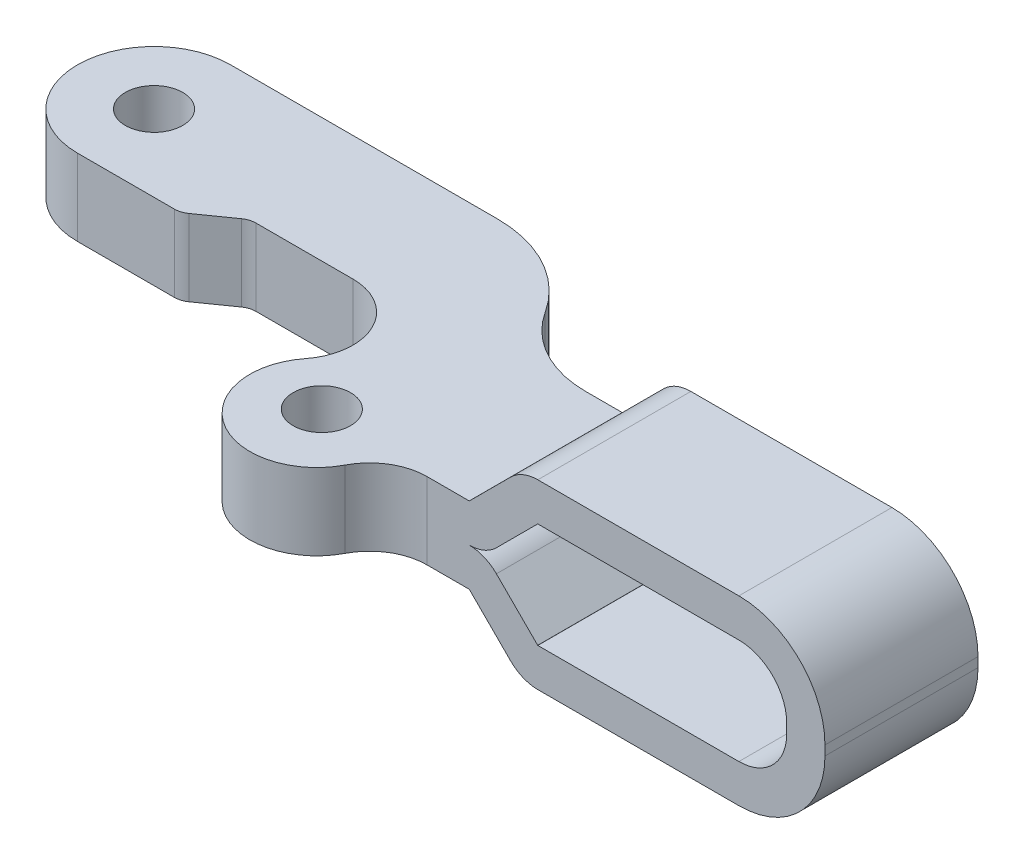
ISO-10303-21;
HEADER;
FILE_DESCRIPTION(('STEP AP214'),'2;1');
FILE_NAME('part.step','',(''),(''),'','','');
FILE_SCHEMA(('AUTOMOTIVE_DESIGN { 1 0 10303 214 1 1 1 1 }'));
ENDSEC;
DATA;
#1=APPLICATION_CONTEXT('core data for automotive mechanical design processes');
#2=APPLICATION_PROTOCOL_DEFINITION('international standard','automotive_design',2000,#1);
#3=PRODUCT_CONTEXT('',#1,'mechanical');
#4=PRODUCT('Part','Part','',(#3));
#5=PRODUCT_RELATED_PRODUCT_CATEGORY('part','',(#4));
#6=PRODUCT_DEFINITION_FORMATION('','',#4);
#7=PRODUCT_DEFINITION_CONTEXT('part definition',#1,'design');
#8=PRODUCT_DEFINITION('design','',#6,#7);
#9=PRODUCT_DEFINITION_SHAPE('','',#8);
#10=(LENGTH_UNIT() NAMED_UNIT(*) SI_UNIT(.MILLI.,.METRE.));
#11=(NAMED_UNIT(*) PLANE_ANGLE_UNIT() SI_UNIT($,.RADIAN.));
#12=(NAMED_UNIT(*) SI_UNIT($,.STERADIAN.) SOLID_ANGLE_UNIT());
#13=UNCERTAINTY_MEASURE_WITH_UNIT(LENGTH_MEASURE(1.E-05),#10,'distance_accuracy_value','');
#14=(GEOMETRIC_REPRESENTATION_CONTEXT(3) GLOBAL_UNCERTAINTY_ASSIGNED_CONTEXT((#13)) GLOBAL_UNIT_ASSIGNED_CONTEXT((#10,
#11,#12)) REPRESENTATION_CONTEXT('',''));
#15=CARTESIAN_POINT('',(0.,0.,0.));
#16=DIRECTION('',(0.,0.,1.));
#17=DIRECTION('',(1.,0.,0.));
#18=AXIS2_PLACEMENT_3D('',#15,#16,#17);
#19=CARTESIAN_POINT('',(45.7788506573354,2.,1.50570552));
#20=DIRECTION('',(0.,0.,1.));
#21=DIRECTION('',(0.,1.,0.));
#22=AXIS2_PLACEMENT_3D('',#19,#20,#21);
#23=PLANE('',#22);
#24=DIRECTION('',(0.,1.,0.));
#25=VECTOR('',#24,1.);
#26=CARTESIAN_POINT('',(44.5788506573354,1.09995593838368,1.50570552));
#27=LINE('',#26,#25);
#28=CARTESIAN_POINT('',(44.5788506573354,-0.25,1.50570552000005));
#29=VERTEX_POINT('',#28);
#30=CARTESIAN_POINT('',(44.5788506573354,0.24999999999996,1.50570552));
#31=VERTEX_POINT('',#30);
#32=EDGE_CURVE('E377',#29,#31,#27,.T.);
#33=ORIENTED_EDGE('',*,*,#32,.F.);
#34=CARTESIAN_POINT('',(40.0788506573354,-0.25000000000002,1.50570552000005));
#35=DIRECTION('',(0.,0.,-1.));
#36=DIRECTION('',(-1.,0.,0.));
#37=AXIS2_PLACEMENT_3D('',#34,#35,#36);
#38=CIRCLE('',#37,4.5);
#39=CARTESIAN_POINT('',(40.0788506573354,-4.75,1.50570552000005));
#40=VERTEX_POINT('',#39);
#41=EDGE_CURVE('E331',#40,#29,#38,.F.);
#42=ORIENTED_EDGE('',*,*,#41,.F.);
#43=DIRECTION('',(-1.,0.,0.));
#44=VECTOR('',#43,1.);
#45=CARTESIAN_POINT('',(11.8413847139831,-4.75,1.50570552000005));
#46=LINE('',#45,#44);
#47=CARTESIAN_POINT('',(29.5689359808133,-4.75,1.50570552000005));
#48=VERTEX_POINT('',#47);
#49=EDGE_CURVE('E320',#40,#48,#46,.T.);
#50=ORIENTED_EDGE('',*,*,#49,.T.);
#51=CARTESIAN_POINT('',(29.5689359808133,-2.74,1.50570552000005));
#52=DIRECTION('',(0.,0.,-1.));
#53=DIRECTION('',(-1.,0.,0.));
#54=AXIS2_PLACEMENT_3D('',#51,#52,#53);
#55=CIRCLE('',#54,2.01);
#56=CARTESIAN_POINT('',(28.1476513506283,-4.16128463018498,1.50570552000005));
#57=VERTEX_POINT('',#56);
#58=EDGE_CURVE('E322',#57,#48,#55,.F.);
#59=ORIENTED_EDGE('',*,*,#58,.F.);
#60=DIRECTION('',(-0.707106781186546,0.707106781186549,0.));
#61=VECTOR('',#60,1.);
#62=CARTESIAN_POINT('',(16.1732936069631,7.81307311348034,1.50570552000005));
#63=LINE('',#62,#61);
#64=CARTESIAN_POINT('',(25.9892956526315,-2.00292893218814,1.50570552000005));
#65=VERTEX_POINT('',#64);
#66=EDGE_CURVE('E301',#57,#65,#63,.T.);
#67=ORIENTED_EDGE('',*,*,#66,.T.);
#68=CARTESIAN_POINT('',(25.9822245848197,-2.01,1.50570552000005));
#69=DIRECTION('',(0.,0.,-1.));
#70=DIRECTION('',(0.,-1.,0.));
#71=AXIS2_PLACEMENT_3D('',#68,#69,#70);
#72=CIRCLE('',#71,0.00999999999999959);
#73=CARTESIAN_POINT('',(25.9822245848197,-2.,1.50570552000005));
#74=VERTEX_POINT('',#73);
#75=EDGE_CURVE('E311',#65,#74,#72,.F.);
#76=ORIENTED_EDGE('',*,*,#75,.T.);
#77=DIRECTION('',(-1.,0.,0.));
#78=VECTOR('',#77,1.);
#79=CARTESIAN_POINT('',(12.8935535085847,-2.,1.50570552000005));
#80=LINE('',#79,#78);
#81=CARTESIAN_POINT('',(24.0552058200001,-2.,1.50570552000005));
#82=VERTEX_POINT('',#81);
#83=EDGE_CURVE('E298',#74,#82,#80,.T.);
#84=ORIENTED_EDGE('',*,*,#83,.T.);
#85=DIRECTION('',(0.,1.,0.));
#86=VECTOR('',#85,1.);
#87=CARTESIAN_POINT('',(24.05520582,2.,1.50570552));
#88=LINE('',#87,#86);
#89=CARTESIAN_POINT('',(24.05520582,2.,1.50570552));
#90=VERTEX_POINT('',#89);
#91=EDGE_CURVE('E898',#90,#82,#88,.F.);
#92=ORIENTED_EDGE('',*,*,#91,.F.);
#93=DIRECTION('',(-1.,0.,0.));
#94=VECTOR('',#93,1.);
#95=CARTESIAN_POINT('',(45.7788506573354,2.,1.50570552));
#96=LINE('',#95,#94);
#97=CARTESIAN_POINT('',(25.9822245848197,2.,1.50570552));
#98=VERTEX_POINT('',#97);
#99=EDGE_CURVE('E24',#98,#90,#96,.T.);
#100=ORIENTED_EDGE('',*,*,#99,.F.);
#101=CARTESIAN_POINT('',(25.9822245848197,2.01,1.50570552));
#102=DIRECTION('',(0.,0.,-1.));
#103=DIRECTION('',(-1.,0.,0.));
#104=AXIS2_PLACEMENT_3D('',#101,#102,#103);
#105=CIRCLE('',#104,0.00999999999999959);
#106=CARTESIAN_POINT('',(25.9892956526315,2.0029289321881,1.50570552));
#107=VERTEX_POINT('',#106);
#108=EDGE_CURVE('E420',#107,#98,#105,.T.);
#109=ORIENTED_EDGE('',*,*,#108,.F.);
#110=DIRECTION('',(-0.707106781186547,-0.707106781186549,0.));
#111=VECTOR('',#110,1.);
#112=CARTESIAN_POINT('',(28.1476513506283,4.16128463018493,1.50570552));
#113=LINE('',#112,#111);
#114=CARTESIAN_POINT('',(28.1476513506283,4.16128463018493,1.50570552));
#115=VERTEX_POINT('',#114);
#116=EDGE_CURVE('E433',#115,#107,#113,.T.);
#117=ORIENTED_EDGE('',*,*,#116,.F.);
#118=CARTESIAN_POINT('',(29.5689359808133,2.74,1.50570552));
#119=DIRECTION('',(0.,0.,-1.));
#120=DIRECTION('',(-1.,0.,0.));
#121=AXIS2_PLACEMENT_3D('',#118,#119,#120);
#122=CIRCLE('',#121,2.01);
#123=CARTESIAN_POINT('',(29.5689359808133,4.75,1.50570552));
#124=VERTEX_POINT('',#123);
#125=EDGE_CURVE('E435',#115,#124,#122,.T.);
#126=ORIENTED_EDGE('',*,*,#125,.T.);
#127=DIRECTION('',(1.,0.,0.));
#128=VECTOR('',#127,1.);
#129=CARTESIAN_POINT('',(44.7266818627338,4.75,1.50570552));
#130=LINE('',#129,#128);
#131=CARTESIAN_POINT('',(40.0788506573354,4.75,1.50570552));
#132=VERTEX_POINT('',#131);
#133=EDGE_CURVE('E448',#132,#124,#130,.F.);
#134=ORIENTED_EDGE('',*,*,#133,.F.);
#135=CARTESIAN_POINT('',(40.0788506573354,0.24999999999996,1.50570552));
#136=DIRECTION('',(0.,0.,-1.));
#137=DIRECTION('',(-1.,0.,0.));
#138=AXIS2_PLACEMENT_3D('',#135,#136,#137);
#139=CIRCLE('',#138,4.5);
#140=EDGE_CURVE('E253',#132,#31,#139,.T.);
#141=ORIENTED_EDGE('',*,*,#140,.T.);
#142=EDGE_LOOP('',(#33,#42,#50,#59,#67,#76,#84,#92,#100,#109,#117,#126,#134,#141));
#143=FACE_BOUND('',#142,.T.);
#144=CARTESIAN_POINT('',(40.0788506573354,-0.25000000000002,1.50570552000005));
#145=DIRECTION('',(0.,0.,-1.));
#146=DIRECTION('',(-1.,0.,0.));
#147=AXIS2_PLACEMENT_3D('',#144,#145,#146);
#148=CIRCLE('',#147,2.5);
#149=CARTESIAN_POINT('',(42.5788506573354,-0.25,1.50570552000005));
#150=VERTEX_POINT('',#149);
#151=CARTESIAN_POINT('',(40.0788506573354,-2.75,1.50570552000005));
#152=VERTEX_POINT('',#151);
#153=EDGE_CURVE('E18',#150,#152,#148,.T.);
#154=ORIENTED_EDGE('',*,*,#153,.F.);
#155=DIRECTION('',(0.,1.,0.));
#156=VECTOR('',#155,1.);
#157=CARTESIAN_POINT('',(42.5788506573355,33.9852530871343,1.50570552));
#158=LINE('',#157,#156);
#159=CARTESIAN_POINT('',(42.5788506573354,0.24999999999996,1.50570552));
#160=VERTEX_POINT('',#159);
#161=EDGE_CURVE('E242',#150,#160,#158,.T.);
#162=ORIENTED_EDGE('',*,*,#161,.T.);
#163=CARTESIAN_POINT('',(40.0788506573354,0.24999999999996,1.50570552));
#164=DIRECTION('',(0.,0.,-1.));
#165=DIRECTION('',(-1.,0.,0.));
#166=AXIS2_PLACEMENT_3D('',#163,#164,#165);
#167=CIRCLE('',#166,2.5);
#168=CARTESIAN_POINT('',(40.0788506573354,2.75,1.50570552));
#169=VERTEX_POINT('',#168);
#170=EDGE_CURVE('E446',#160,#169,#167,.F.);
#171=ORIENTED_EDGE('',*,*,#170,.T.);
#172=DIRECTION('',(-1.,0.,0.));
#173=VECTOR('',#172,1.);
#174=CARTESIAN_POINT('',(11.8413847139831,2.75,1.50570552));
#175=LINE('',#174,#173);
#176=CARTESIAN_POINT('',(29.5689359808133,2.75,1.50570552));
#177=VERTEX_POINT('',#176);
#178=EDGE_CURVE('E442',#169,#177,#175,.T.);
#179=ORIENTED_EDGE('',*,*,#178,.T.);
#180=CARTESIAN_POINT('',(29.5689359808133,2.74,1.50570552));
#181=DIRECTION('',(0.,0.,-1.));
#182=DIRECTION('',(0.,-1.,0.));
#183=AXIS2_PLACEMENT_3D('',#180,#181,#182);
#184=CIRCLE('',#183,0.00999999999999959);
#185=CARTESIAN_POINT('',(29.5618649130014,2.74707106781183,1.50570552));
#186=VERTEX_POINT('',#185);
#187=EDGE_CURVE('E431',#177,#186,#184,.F.);
#188=ORIENTED_EDGE('',*,*,#187,.T.);
#189=DIRECTION('',(-0.707106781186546,-0.707106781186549,0.));
#190=VECTOR('',#189,1.);
#191=CARTESIAN_POINT('',(17.5875071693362,-9.22728667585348,1.50570552));
#192=LINE('',#191,#190);
#193=CARTESIAN_POINT('',(27.4035092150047,0.58871536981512,1.50570552));
#194=VERTEX_POINT('',#193);
#195=EDGE_CURVE('E423',#186,#194,#192,.T.);
#196=ORIENTED_EDGE('',*,*,#195,.T.);
#197=CARTESIAN_POINT('',(25.9822245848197,2.01,1.50570552));
#198=DIRECTION('',(0.,0.,-1.));
#199=DIRECTION('',(-1.,0.,0.));
#200=AXIS2_PLACEMENT_3D('',#197,#198,#199);
#201=CIRCLE('',#200,2.01);
#202=CARTESIAN_POINT('',(25.9822245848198,0.,1.50570552));
#203=VERTEX_POINT('',#202);
#204=EDGE_CURVE('E390',#203,#194,#201,.F.);
#205=ORIENTED_EDGE('',*,*,#204,.F.);
#206=CARTESIAN_POINT('',(25.9822245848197,-2.01,1.50570552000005));
#207=DIRECTION('',(0.,0.,-1.));
#208=DIRECTION('',(-1.,0.,0.));
#209=AXIS2_PLACEMENT_3D('',#206,#207,#208);
#210=CIRCLE('',#209,2.01);
#211=CARTESIAN_POINT('',(27.4035092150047,-0.588715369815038,1.50570552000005));
#212=VERTEX_POINT('',#211);
#213=EDGE_CURVE('E308',#203,#212,#210,.T.);
#214=ORIENTED_EDGE('',*,*,#213,.T.);
#215=DIRECTION('',(-0.707106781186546,0.70710678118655,0.));
#216=VECTOR('',#215,1.);
#217=CARTESIAN_POINT('',(29.5618649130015,-2.74707106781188,1.50570552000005));
#218=LINE('',#217,#216);
#219=CARTESIAN_POINT('',(29.5618649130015,-2.74707106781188,1.50570552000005));
#220=VERTEX_POINT('',#219);
#221=EDGE_CURVE('E316',#220,#212,#218,.T.);
#222=ORIENTED_EDGE('',*,*,#221,.F.);
#223=CARTESIAN_POINT('',(29.5689359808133,-2.74,1.50570552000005));
#224=DIRECTION('',(0.,0.,-1.));
#225=DIRECTION('',(-1.,0.,0.));
#226=AXIS2_PLACEMENT_3D('',#223,#224,#225);
#227=CIRCLE('',#226,0.00999999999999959);
#228=CARTESIAN_POINT('',(29.5689359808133,-2.75,1.50570552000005));
#229=VERTEX_POINT('',#228);
#230=EDGE_CURVE('E325',#229,#220,#227,.T.);
#231=ORIENTED_EDGE('',*,*,#230,.F.);
#232=DIRECTION('',(1.,0.,0.));
#233=VECTOR('',#232,1.);
#234=CARTESIAN_POINT('',(44.7266818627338,-2.75,1.50570552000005));
#235=LINE('',#234,#233);
#236=EDGE_CURVE('E266',#152,#229,#235,.F.);
#237=ORIENTED_EDGE('',*,*,#236,.F.);
#238=EDGE_LOOP('',(#154,#162,#171,#179,#188,#196,#205,#214,#222,#231,#237));
#239=FACE_BOUND('',#238,.T.);
#240=ADVANCED_FACE('F14',(#143,#239),#23,.F.);
#241=CARTESIAN_POINT('',(24.05520582,2.,-3.99429447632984));
#242=DIRECTION('',(0.,-1.,0.));
#243=DIRECTION('',(1.,0.,0.));
#244=AXIS2_PLACEMENT_3D('',#241,#242,#243);
#245=CYLINDRICAL_SURFACE('',#244,5.49999999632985);
#246=DIRECTION('',(0.,-1.,0.));
#247=VECTOR('',#246,1.);
#248=CARTESIAN_POINT('',(19.4302582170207,2.,-1.01774284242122));
#249=LINE('',#248,#247);
#250=CARTESIAN_POINT('',(19.4302582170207,2.,-1.01774284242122));
#251=VERTEX_POINT('',#250);
#252=CARTESIAN_POINT('',(19.4302582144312,-2.,-1.01774284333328));
#253=VERTEX_POINT('',#252);
#254=EDGE_CURVE('E411',#251,#253,#249,.T.);
#255=ORIENTED_EDGE('',*,*,#254,.F.);
#256=CARTESIAN_POINT('',(24.05520582,2.,-3.99429447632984));
#257=DIRECTION('',(0.,-1.,0.));
#258=DIRECTION('',(1.,0.,0.));
#259=AXIS2_PLACEMENT_3D('',#256,#257,#258);
#260=CIRCLE('',#259,5.49999999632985);
#261=EDGE_CURVE('E412',#90,#251,#260,.T.);
#262=ORIENTED_EDGE('',*,*,#261,.F.);
#263=ORIENTED_EDGE('',*,*,#91,.T.);
#264=CARTESIAN_POINT('',(24.0552058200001,-2.,-3.99429447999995));
#265=DIRECTION('',(0.,-1.,0.));
#266=DIRECTION('',(1.,0.,0.));
#267=AXIS2_PLACEMENT_3D('',#264,#265,#266);
#268=CIRCLE('',#267,5.5);
#269=EDGE_CURVE('E295',#82,#253,#268,.T.);
#270=ORIENTED_EDGE('',*,*,#269,.T.);
#271=EDGE_LOOP('',(#255,#262,#263,#270));
#272=FACE_BOUND('',#271,.T.);
#273=ADVANCED_FACE('F535',(#272),#245,.F.);
#274=CARTESIAN_POINT('',(13.9644110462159,2.,2.5));
#275=DIRECTION('',(0.,-1.,0.));
#276=DIRECTION('',(1.,0.,0.));
#277=AXIS2_PLACEMENT_3D('',#274,#275,#276);
#278=CYLINDRICAL_SURFACE('',#277,6.5);
#279=CARTESIAN_POINT('',(13.9644110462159,2.,2.5));
#280=DIRECTION('',(0.,-1.,0.));
#281=DIRECTION('',(1.,0.,0.));
#282=AXIS2_PLACEMENT_3D('',#279,#280,#281);
#283=CIRCLE('',#282,6.5);
#284=CARTESIAN_POINT('',(13.9644110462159,2.,-4.));
#285=VERTEX_POINT('',#284);
#286=EDGE_CURVE('E409',#285,#251,#283,.T.);
#287=ORIENTED_EDGE('',*,*,#286,.T.);
#288=ORIENTED_EDGE('',*,*,#254,.T.);
#289=CARTESIAN_POINT('',(13.9644110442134,-2.,2.5000000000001));
#290=DIRECTION('',(0.,-1.,0.));
#291=DIRECTION('',(1.,0.,0.));
#292=AXIS2_PLACEMENT_3D('',#289,#290,#291);
#293=CIRCLE('',#292,6.5);
#294=CARTESIAN_POINT('',(13.9644110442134,-2.,-3.99999999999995));
#295=VERTEX_POINT('',#294);
#296=EDGE_CURVE('E292',#253,#295,#293,.F.);
#297=ORIENTED_EDGE('',*,*,#296,.T.);
#298=DIRECTION('',(0.,1.,0.));
#299=VECTOR('',#298,1.);
#300=CARTESIAN_POINT('',(13.9644110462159,2.,-4.));
#301=LINE('',#300,#299);
#302=EDGE_CURVE('E972',#295,#285,#301,.T.);
#303=ORIENTED_EDGE('',*,*,#302,.T.);
#304=EDGE_LOOP('',(#287,#288,#297,#303));
#305=FACE_BOUND('',#304,.T.);
#306=ADVANCED_FACE('F541',(#305),#278,.T.);
#307=CARTESIAN_POINT('',(0.,2.,-4.));
#308=DIRECTION('',(0.,0.,1.));
#309=DIRECTION('',(1.,0.,0.));
#310=AXIS2_PLACEMENT_3D('',#307,#308,#309);
#311=PLANE('',#310);
#312=DIRECTION('',(0.,-1.,0.));
#313=VECTOR('',#312,1.);
#314=CARTESIAN_POINT('',(0.,2.,-4.));
#315=LINE('',#314,#313);
#316=CARTESIAN_POINT('',(0.,2.,-4.));
#317=VERTEX_POINT('',#316);
#318=CARTESIAN_POINT('',(0.,-2.,-3.99999999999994));
#319=VERTEX_POINT('',#318);
#320=EDGE_CURVE('E407',#317,#319,#315,.T.);
#321=ORIENTED_EDGE('',*,*,#320,.F.);
#322=DIRECTION('',(1.,0.,0.));
#323=VECTOR('',#322,1.);
#324=CARTESIAN_POINT('',(0.,2.,-4.));
#325=LINE('',#324,#323);
#326=EDGE_CURVE('E408',#285,#317,#325,.F.);
#327=ORIENTED_EDGE('',*,*,#326,.F.);
#328=ORIENTED_EDGE('',*,*,#302,.F.);
#329=DIRECTION('',(-1.,0.,0.));
#330=VECTOR('',#329,1.);
#331=CARTESIAN_POINT('',(12.8935535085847,-2.,-3.99999999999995));
#332=LINE('',#331,#330);
#333=EDGE_CURVE('E291',#295,#319,#332,.T.);
#334=ORIENTED_EDGE('',*,*,#333,.T.);
#335=EDGE_LOOP('',(#321,#327,#328,#334));
#336=FACE_BOUND('',#335,.T.);
#337=ADVANCED_FACE('F581',(#336),#311,.F.);
#338=CARTESIAN_POINT('',(0.,2.,0.));
#339=DIRECTION('',(0.,-1.,0.));
#340=DIRECTION('',(1.,0.,0.));
#341=AXIS2_PLACEMENT_3D('',#338,#339,#340);
#342=CYLINDRICAL_SURFACE('',#341,4.);
#343=CARTESIAN_POINT('',(0.,2.,0.));
#344=DIRECTION('',(0.,-1.,0.));
#345=DIRECTION('',(1.,0.,0.));
#346=AXIS2_PLACEMENT_3D('',#343,#344,#345);
#347=CIRCLE('',#346,4.);
#348=CARTESIAN_POINT('',(0.,2.,4.));
#349=VERTEX_POINT('',#348);
#350=EDGE_CURVE('E405',#349,#317,#347,.T.);
#351=ORIENTED_EDGE('',*,*,#350,.T.);
#352=ORIENTED_EDGE('',*,*,#320,.T.);
#353=CARTESIAN_POINT('',(0.,-2.,0.));
#354=DIRECTION('',(0.,-1.,0.));
#355=DIRECTION('',(1.,0.,0.));
#356=AXIS2_PLACEMENT_3D('',#353,#354,#355);
#357=CIRCLE('',#356,4.);
#358=CARTESIAN_POINT('',(0.,-2.,4.00000000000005));
#359=VERTEX_POINT('',#358);
#360=EDGE_CURVE('E287',#319,#359,#357,.F.);
#361=ORIENTED_EDGE('',*,*,#360,.T.);
#362=DIRECTION('',(0.,1.,0.));
#363=VECTOR('',#362,1.);
#364=CARTESIAN_POINT('',(0.,2.,4.));
#365=LINE('',#364,#363);
#366=EDGE_CURVE('E966',#359,#349,#365,.T.);
#367=ORIENTED_EDGE('',*,*,#366,.T.);
#368=EDGE_LOOP('',(#351,#352,#361,#367));
#369=FACE_BOUND('',#368,.T.);
#370=ADVANCED_FACE('F577',(#369),#342,.T.);
#371=CARTESIAN_POINT('',(5.06610449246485,2.,3.));
#372=DIRECTION('',(0.,-1.,0.));
#373=DIRECTION('',(1.,0.,0.));
#374=AXIS2_PLACEMENT_3D('',#371,#372,#373);
#375=CYLINDRICAL_SURFACE('',#374,1.);
#376=CARTESIAN_POINT('',(5.06610449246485,2.,3.));
#377=DIRECTION('',(0.,-1.,0.));
#378=DIRECTION('',(1.,0.,0.));
#379=AXIS2_PLACEMENT_3D('',#376,#377,#378);
#380=CIRCLE('',#379,1.);
#381=CARTESIAN_POINT('',(5.06610449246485,2.,4.));
#382=VERTEX_POINT('',#381);
#383=CARTESIAN_POINT('',(5.64216294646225,2.,3.8174085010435));
#384=VERTEX_POINT('',#383);
#385=EDGE_CURVE('E417',#382,#384,#380,.F.);
#386=ORIENTED_EDGE('',*,*,#385,.F.);
#387=DIRECTION('',(0.,1.,0.));
#388=VECTOR('',#387,1.);
#389=CARTESIAN_POINT('',(5.06610449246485,2.,4.));
#390=LINE('',#389,#388);
#391=CARTESIAN_POINT('',(5.0661044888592,-2.,4.00000000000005));
#392=VERTEX_POINT('',#391);
#393=EDGE_CURVE('E964',#382,#392,#390,.F.);
#394=ORIENTED_EDGE('',*,*,#393,.T.);
#395=CARTESIAN_POINT('',(5.0661044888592,-2.,3.00000000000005));
#396=DIRECTION('',(0.,-1.,0.));
#397=DIRECTION('',(1.,0.,0.));
#398=AXIS2_PLACEMENT_3D('',#395,#396,#397);
#399=CIRCLE('',#398,1.);
#400=CARTESIAN_POINT('',(5.64216294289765,-2.,3.8174085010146));
#401=VERTEX_POINT('',#400);
#402=EDGE_CURVE('E305',#392,#401,#399,.F.);
#403=ORIENTED_EDGE('',*,*,#402,.T.);
#404=DIRECTION('',(0.,1.,0.));
#405=VECTOR('',#404,1.);
#406=CARTESIAN_POINT('',(5.6421629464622,2.,3.8174085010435));
#407=LINE('',#406,#405);
#408=EDGE_CURVE('E960',#401,#384,#407,.T.);
#409=ORIENTED_EDGE('',*,*,#408,.T.);
#410=EDGE_LOOP('',(#386,#394,#403,#409));
#411=FACE_BOUND('',#410,.T.);
#412=ADVANCED_FACE('F580',(#411),#375,.T.);
#413=CARTESIAN_POINT('',(7.82849039,2.,3.5));
#414=DIRECTION('',(0.,-1.,0.));
#415=DIRECTION('',(1.,0.,0.));
#416=AXIS2_PLACEMENT_3D('',#413,#414,#415);
#417=CYLINDRICAL_SURFACE('',#416,1.);
#418=DIRECTION('',(0.,1.,0.));
#419=VECTOR('',#418,1.);
#420=CARTESIAN_POINT('',(7.82849039,2.,2.5));
#421=LINE('',#420,#419);
#422=CARTESIAN_POINT('',(7.82849038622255,-2.,2.50000000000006));
#423=VERTEX_POINT('',#422);
#424=CARTESIAN_POINT('',(7.82849039,2.,2.5));
#425=VERTEX_POINT('',#424);
#426=EDGE_CURVE('E956',#423,#425,#421,.T.);
#427=ORIENTED_EDGE('',*,*,#426,.T.);
#428=CARTESIAN_POINT('',(7.82849039,2.,3.5));
#429=DIRECTION('',(0.,-1.,0.));
#430=DIRECTION('',(1.,0.,0.));
#431=AXIS2_PLACEMENT_3D('',#428,#429,#430);
#432=CIRCLE('',#431,1.);
#433=CARTESIAN_POINT('',(7.25243193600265,2.,2.68259149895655));
#434=VERTEX_POINT('',#433);
#435=EDGE_CURVE('E415',#434,#425,#432,.T.);
#436=ORIENTED_EDGE('',*,*,#435,.F.);
#437=DIRECTION('',(0.,1.,0.));
#438=VECTOR('',#437,1.);
#439=CARTESIAN_POINT('',(7.2524319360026,2.,2.68259149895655));
#440=LINE('',#439,#438);
#441=CARTESIAN_POINT('',(7.25243193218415,-2.,2.6825914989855));
#442=VERTEX_POINT('',#441);
#443=EDGE_CURVE('E959',#434,#442,#440,.F.);
#444=ORIENTED_EDGE('',*,*,#443,.T.);
#445=CARTESIAN_POINT('',(7.82849038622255,-2.,3.50000000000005));
#446=DIRECTION('',(0.,-1.,0.));
#447=DIRECTION('',(1.,0.,0.));
#448=AXIS2_PLACEMENT_3D('',#445,#446,#447);
#449=CIRCLE('',#448,1.);
#450=EDGE_CURVE('E302',#423,#442,#449,.F.);
#451=ORIENTED_EDGE('',*,*,#450,.F.);
#452=EDGE_LOOP('',(#427,#436,#444,#451));
#453=FACE_BOUND('',#452,.T.);
#454=ADVANCED_FACE('F569',(#453),#417,.F.);
#455=CARTESIAN_POINT('',(12.8935535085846,2.,2.5));
#456=DIRECTION('',(0.,0.,-1.));
#457=DIRECTION('',(-1.,0.,0.));
#458=AXIS2_PLACEMENT_3D('',#455,#456,#457);
#459=PLANE('',#458);
#460=DIRECTION('',(0.,-1.,0.));
#461=VECTOR('',#460,1.);
#462=CARTESIAN_POINT('',(12.8935535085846,2.,2.5));
#463=LINE('',#462,#461);
#464=CARTESIAN_POINT('',(12.8935535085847,-2.,2.50000000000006));
#465=VERTEX_POINT('',#464);
#466=CARTESIAN_POINT('',(12.8935535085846,2.,2.5));
#467=VERTEX_POINT('',#466);
#468=EDGE_CURVE('E404',#465,#467,#463,.F.);
#469=ORIENTED_EDGE('',*,*,#468,.T.);
#470=DIRECTION('',(-1.,0.,0.));
#471=VECTOR('',#470,1.);
#472=CARTESIAN_POINT('',(12.8935535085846,2.,2.5));
#473=LINE('',#472,#471);
#474=EDGE_CURVE('E955',#425,#467,#473,.F.);
#475=ORIENTED_EDGE('',*,*,#474,.F.);
#476=ORIENTED_EDGE('',*,*,#426,.F.);
#477=DIRECTION('',(-1.,0.,0.));
#478=VECTOR('',#477,1.);
#479=CARTESIAN_POINT('',(12.8935535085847,-2.,2.50000000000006));
#480=LINE('',#479,#478);
#481=EDGE_CURVE('E286',#423,#465,#480,.F.);
#482=ORIENTED_EDGE('',*,*,#481,.T.);
#483=EDGE_LOOP('',(#469,#475,#476,#482));
#484=FACE_BOUND('',#483,.T.);
#485=ADVANCED_FACE('F565',(#484),#459,.F.);
#486=CARTESIAN_POINT('',(12.8935535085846,2.,5.5));
#487=DIRECTION('',(0.,-1.,0.));
#488=DIRECTION('',(1.,0.,0.));
#489=AXIS2_PLACEMENT_3D('',#486,#487,#488);
#490=CYLINDRICAL_SURFACE('',#489,3.);
#491=CARTESIAN_POINT('',(12.8935535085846,2.,5.5));
#492=DIRECTION('',(0.,-1.,0.));
#493=DIRECTION('',(1.,0.,0.));
#494=AXIS2_PLACEMENT_3D('',#491,#492,#493);
#495=CIRCLE('',#494,3.);
#496=CARTESIAN_POINT('',(15.2561762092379,2.,7.34878716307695));
#497=VERTEX_POINT('',#496);
#498=EDGE_CURVE('E401',#467,#497,#495,.T.);
#499=ORIENTED_EDGE('',*,*,#498,.F.);
#500=ORIENTED_EDGE('',*,*,#468,.F.);
#501=CARTESIAN_POINT('',(12.8935535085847,-2.,5.5));
#502=DIRECTION('',(0.,-1.,0.));
#503=DIRECTION('',(1.,0.,0.));
#504=AXIS2_PLACEMENT_3D('',#501,#502,#503);
#505=CIRCLE('',#504,3.);
#506=CARTESIAN_POINT('',(15.256176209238,-2.,7.348787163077));
#507=VERTEX_POINT('',#506);
#508=EDGE_CURVE('E283',#465,#507,#505,.T.);
#509=ORIENTED_EDGE('',*,*,#508,.T.);
#510=DIRECTION('',(0.,-1.,0.));
#511=VECTOR('',#510,1.);
#512=CARTESIAN_POINT('',(15.2561762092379,2.,7.34878716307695));
#513=LINE('',#512,#511);
#514=EDGE_CURVE('E400',#497,#507,#513,.T.);
#515=ORIENTED_EDGE('',*,*,#514,.F.);
#516=EDGE_LOOP('',(#499,#500,#509,#515));
#517=FACE_BOUND('',#516,.T.);
#518=ADVANCED_FACE('F561',(#517),#490,.F.);
#519=CARTESIAN_POINT('',(18.01256936,2.,9.50570552));
#520=DIRECTION('',(0.,-1.,0.));
#521=DIRECTION('',(1.,0.,0.));
#522=AXIS2_PLACEMENT_3D('',#519,#520,#521);
#523=CYLINDRICAL_SURFACE('',#522,3.5);
#524=CARTESIAN_POINT('',(18.01256936,2.,9.50570552));
#525=DIRECTION('',(0.,-1.,0.));
#526=DIRECTION('',(1.,0.,0.));
#527=AXIS2_PLACEMENT_3D('',#524,#525,#526);
#528=CIRCLE('',#527,3.5);
#529=CARTESIAN_POINT('',(21.1174900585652,2.,11.1210901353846));
#530=VERTEX_POINT('',#529);
#531=EDGE_CURVE('E398',#530,#497,#528,.T.);
#532=ORIENTED_EDGE('',*,*,#531,.T.);
#533=ORIENTED_EDGE('',*,*,#514,.T.);
#534=CARTESIAN_POINT('',(18.0125693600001,-2.,9.50570552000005));
#535=DIRECTION('',(0.,-1.,0.));
#536=DIRECTION('',(1.,0.,0.));
#537=AXIS2_PLACEMENT_3D('',#534,#535,#536);
#538=CIRCLE('',#537,3.5);
#539=CARTESIAN_POINT('',(21.1174900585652,-2.,11.1210901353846));
#540=VERTEX_POINT('',#539);
#541=EDGE_CURVE('E280',#507,#540,#538,.F.);
#542=ORIENTED_EDGE('',*,*,#541,.T.);
#543=DIRECTION('',(0.,-1.,0.));
#544=VECTOR('',#543,1.);
#545=CARTESIAN_POINT('',(21.1174900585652,2.,11.1210901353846));
#546=LINE('',#545,#544);
#547=EDGE_CURVE('E397',#540,#530,#546,.F.);
#548=ORIENTED_EDGE('',*,*,#547,.T.);
#549=EDGE_LOOP('',(#532,#533,#542,#548));
#550=FACE_BOUND('',#549,.T.);
#551=ADVANCED_FACE('F557',(#550),#523,.T.);
#552=CARTESIAN_POINT('',(40.0788506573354,0.24999999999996,15.4165916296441));
#553=DIRECTION('',(0.,0.,-1.));
#554=DIRECTION('',(-1.,0.,0.));
#555=AXIS2_PLACEMENT_3D('',#552,#553,#554);
#556=CYLINDRICAL_SURFACE('',#555,2.5);
#557=DIRECTION('',(0.,0.,-1.));
#558=VECTOR('',#557,1.);
#559=CARTESIAN_POINT('',(42.5788506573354,0.249999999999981,15.4165916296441));
#560=LINE('',#559,#558);
#561=CARTESIAN_POINT('',(42.5788506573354,0.249999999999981,9.50570552));
#562=VERTEX_POINT('',#561);
#563=EDGE_CURVE('E248',#562,#160,#560,.T.);
#564=ORIENTED_EDGE('',*,*,#563,.F.);
#565=CARTESIAN_POINT('',(40.0788506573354,0.24999999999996,9.50570552));
#566=DIRECTION('',(0.,0.,-1.));
#567=DIRECTION('',(-1.,0.,0.));
#568=AXIS2_PLACEMENT_3D('',#565,#566,#567);
#569=CIRCLE('',#568,2.5);
#570=CARTESIAN_POINT('',(40.0788506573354,2.75,9.50570552));
#571=VERTEX_POINT('',#570);
#572=EDGE_CURVE('E374',#571,#562,#569,.T.);
#573=ORIENTED_EDGE('',*,*,#572,.F.);
#574=DIRECTION('',(0.,0.,1.));
#575=VECTOR('',#574,1.);
#576=CARTESIAN_POINT('',(40.0788506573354,2.75,5.5));
#577=LINE('',#576,#575);
#578=EDGE_CURVE('E439',#571,#169,#577,.F.);
#579=ORIENTED_EDGE('',*,*,#578,.T.);
#580=ORIENTED_EDGE('',*,*,#170,.F.);
#581=EDGE_LOOP('',(#564,#573,#579,#580));
#582=FACE_BOUND('',#581,.T.);
#583=ADVANCED_FACE('F560',(#582),#556,.F.);
#584=CARTESIAN_POINT('',(11.8413847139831,2.75,5.5));
#585=DIRECTION('',(0.,1.,0.));
#586=DIRECTION('',(-1.,0.,0.));
#587=AXIS2_PLACEMENT_3D('',#584,#585,#586);
#588=PLANE('',#587);
#589=DIRECTION('',(-1.,0.,0.));
#590=VECTOR('',#589,1.);
#591=CARTESIAN_POINT('',(11.8413847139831,2.75,9.50570552));
#592=LINE('',#591,#590);
#593=CARTESIAN_POINT('',(29.5689359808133,2.75,9.50570552));
#594=VERTEX_POINT('',#593);
#595=EDGE_CURVE('E914',#594,#571,#592,.F.);
#596=ORIENTED_EDGE('',*,*,#595,.F.);
#597=DIRECTION('',(0.,0.,-1.));
#598=VECTOR('',#597,1.);
#599=CARTESIAN_POINT('',(29.5689359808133,2.75,13.979326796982));
#600=LINE('',#599,#598);
#601=EDGE_CURVE('E434',#594,#177,#600,.T.);
#602=ORIENTED_EDGE('',*,*,#601,.T.);
#603=ORIENTED_EDGE('',*,*,#178,.F.);
#604=ORIENTED_EDGE('',*,*,#578,.F.);
#605=EDGE_LOOP('',(#596,#602,#603,#604));
#606=FACE_BOUND('',#605,.T.);
#607=ADVANCED_FACE('F617',(#606),#588,.F.);
#608=CARTESIAN_POINT('',(29.5689359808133,2.74,13.979326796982));
#609=DIRECTION('',(0.,0.,-1.));
#610=DIRECTION('',(-1.,0.,0.));
#611=AXIS2_PLACEMENT_3D('',#608,#609,#610);
#612=CYLINDRICAL_SURFACE('',#611,0.00999999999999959);
#613=ORIENTED_EDGE('',*,*,#187,.F.);
#614=ORIENTED_EDGE('',*,*,#601,.F.);
#615=CARTESIAN_POINT('',(29.5689359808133,2.74,9.50570552));
#616=DIRECTION('',(0.,0.,1.));
#617=DIRECTION('',(0.,1.,0.));
#618=AXIS2_PLACEMENT_3D('',#615,#616,#617);
#619=CIRCLE('',#618,0.00999999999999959);
#620=CARTESIAN_POINT('',(29.5618649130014,2.74707106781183,9.50570552));
#621=VERTEX_POINT('',#620);
#622=EDGE_CURVE('E443',#621,#594,#619,.F.);
#623=ORIENTED_EDGE('',*,*,#622,.F.);
#624=DIRECTION('',(0.,0.,1.));
#625=VECTOR('',#624,1.);
#626=CARTESIAN_POINT('',(29.5618649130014,2.74707106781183,5.5));
#627=LINE('',#626,#625);
#628=EDGE_CURVE('E902',#621,#186,#627,.F.);
#629=ORIENTED_EDGE('',*,*,#628,.T.);
#630=EDGE_LOOP('',(#613,#614,#623,#629));
#631=FACE_BOUND('',#630,.T.);
#632=ADVANCED_FACE('F595',(#631),#612,.F.);
#633=CARTESIAN_POINT('',(17.5875071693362,-9.22728667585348,5.5));
#634=DIRECTION('',(-0.707106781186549,0.707106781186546,0.));
#635=DIRECTION('',(-0.707106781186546,-0.707106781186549,0.));
#636=AXIS2_PLACEMENT_3D('',#633,#634,#635);
#637=PLANE('',#636);
#638=ORIENTED_EDGE('',*,*,#628,.F.);
#639=DIRECTION('',(-0.707106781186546,-0.707106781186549,0.));
#640=VECTOR('',#639,1.);
#641=CARTESIAN_POINT('',(17.5875071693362,-9.22728667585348,9.50570552));
#642=LINE('',#641,#640);
#643=CARTESIAN_POINT('',(27.4035092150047,0.58871536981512,9.50570552));
#644=VERTEX_POINT('',#643);
#645=EDGE_CURVE('E426',#644,#621,#642,.F.);
#646=ORIENTED_EDGE('',*,*,#645,.F.);
#647=DIRECTION('',(0.,0.,-1.));
#648=VECTOR('',#647,1.);
#649=CARTESIAN_POINT('',(27.4035092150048,0.58871536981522,13.7899827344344));
#650=LINE('',#649,#648);
#651=EDGE_CURVE('E392',#194,#644,#650,.F.);
#652=ORIENTED_EDGE('',*,*,#651,.F.);
#653=ORIENTED_EDGE('',*,*,#195,.F.);
#654=EDGE_LOOP('',(#638,#646,#652,#653));
#655=FACE_BOUND('',#654,.T.);
#656=ADVANCED_FACE('F549',(#655),#637,.F.);
#657=CARTESIAN_POINT('',(25.9822245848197,2.01,13.7899827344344));
#658=DIRECTION('',(0.,0.,-1.));
#659=DIRECTION('',(-1.,0.,0.));
#660=AXIS2_PLACEMENT_3D('',#657,#658,#659);
#661=CYLINDRICAL_SURFACE('',#660,2.01);
#662=ORIENTED_EDGE('',*,*,#651,.T.);
#663=CARTESIAN_POINT('',(25.9822245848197,2.01,9.50570552));
#664=DIRECTION('',(0.,0.,-1.));
#665=DIRECTION('',(-1.,0.,0.));
#666=AXIS2_PLACEMENT_3D('',#663,#664,#665);
#667=CIRCLE('',#666,2.01);
#668=CARTESIAN_POINT('',(25.9822245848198,0.,9.50570552));
#669=VERTEX_POINT('',#668);
#670=EDGE_CURVE('E424',#644,#669,#667,.T.);
#671=ORIENTED_EDGE('',*,*,#670,.T.);
#672=DIRECTION('',(0.,0.,1.));
#673=VECTOR('',#672,1.);
#674=CARTESIAN_POINT('',(25.98222458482,0.,5.5));
#675=LINE('',#674,#673);
#676=EDGE_CURVE('E9',#669,#203,#675,.F.);
#677=ORIENTED_EDGE('',*,*,#676,.T.);
#678=ORIENTED_EDGE('',*,*,#204,.T.);
#679=EDGE_LOOP('',(#662,#671,#677,#678));
#680=FACE_BOUND('',#679,.T.);
#681=ADVANCED_FACE('F545',(#680),#661,.T.);
#682=CARTESIAN_POINT('',(23.7788506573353,2.,12.5057055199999));
#683=DIRECTION('',(0.,-1.,0.));
#684=DIRECTION('',(1.,0.,0.));
#685=AXIS2_PLACEMENT_3D('',#682,#683,#684);
#686=CYLINDRICAL_SURFACE('',#685,2.99999999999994);
#687=DIRECTION('',(0.,1.,0.));
#688=VECTOR('',#687,1.);
#689=CARTESIAN_POINT('',(23.7788506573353,2.,9.50570552));
#690=LINE('',#689,#688);
#691=CARTESIAN_POINT('',(23.7788506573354,-2.,9.50570552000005));
#692=VERTEX_POINT('',#691);
#693=CARTESIAN_POINT('',(23.7788506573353,2.,9.50570552));
#694=VERTEX_POINT('',#693);
#695=EDGE_CURVE('E396',#692,#694,#690,.T.);
#696=ORIENTED_EDGE('',*,*,#695,.T.);
#697=CARTESIAN_POINT('',(23.7788506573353,2.,12.5057055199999));
#698=DIRECTION('',(0.,-1.,0.));
#699=DIRECTION('',(1.,0.,0.));
#700=AXIS2_PLACEMENT_3D('',#697,#698,#699);
#701=CIRCLE('',#700,2.99999999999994);
#702=EDGE_CURVE('E394',#530,#694,#701,.T.);
#703=ORIENTED_EDGE('',*,*,#702,.F.);
#704=ORIENTED_EDGE('',*,*,#547,.F.);
#705=CARTESIAN_POINT('',(23.7788506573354,-2.,12.50570552));
#706=DIRECTION('',(0.,-1.,0.));
#707=DIRECTION('',(1.,0.,0.));
#708=AXIS2_PLACEMENT_3D('',#705,#706,#707);
#709=CIRCLE('',#708,2.99999999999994);
#710=EDGE_CURVE('E276',#540,#692,#709,.T.);
#711=ORIENTED_EDGE('',*,*,#710,.T.);
#712=EDGE_LOOP('',(#696,#703,#704,#711));
#713=FACE_BOUND('',#712,.T.);
#714=ADVANCED_FACE('F548',(#713),#686,.F.);
#715=CARTESIAN_POINT('',(12.8935535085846,2.,5.5));
#716=DIRECTION('',(0.,1.,0.));
#717=DIRECTION('',(-1.,0.,0.));
#718=AXIS2_PLACEMENT_3D('',#715,#716,#717);
#719=PLANE('',#718);
#720=ORIENTED_EDGE('',*,*,#702,.T.);
#721=DIRECTION('',(-1.,0.,0.));
#722=VECTOR('',#721,1.);
#723=CARTESIAN_POINT('',(45.7788506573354,2.,9.50570552));
#724=LINE('',#723,#722);
#725=CARTESIAN_POINT('',(25.9822245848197,2.,9.50570552));
#726=VERTEX_POINT('',#725);
#727=EDGE_CURVE('E393',#694,#726,#724,.F.);
#728=ORIENTED_EDGE('',*,*,#727,.T.);
#729=DIRECTION('',(0.,0.,1.));
#730=VECTOR('',#729,1.);
#731=CARTESIAN_POINT('',(25.9822245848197,2.,5.5));
#732=LINE('',#731,#730);
#733=EDGE_CURVE('E419',#726,#98,#732,.F.);
#734=ORIENTED_EDGE('',*,*,#733,.T.);
#735=ORIENTED_EDGE('',*,*,#99,.T.);
#736=ORIENTED_EDGE('',*,*,#261,.T.);
#737=ORIENTED_EDGE('',*,*,#286,.F.);
#738=ORIENTED_EDGE('',*,*,#326,.T.);
#739=ORIENTED_EDGE('',*,*,#350,.F.);
#740=DIRECTION('',(-1.,0.,0.));
#741=VECTOR('',#740,1.);
#742=CARTESIAN_POINT('',(0.,2.,4.));
#743=LINE('',#742,#741);
#744=EDGE_CURVE('E969',#349,#382,#743,.F.);
#745=ORIENTED_EDGE('',*,*,#744,.T.);
#746=ORIENTED_EDGE('',*,*,#385,.T.);
#747=DIRECTION('',(-0.817408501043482,0.,0.576058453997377));
#748=VECTOR('',#747,1.);
#749=CARTESIAN_POINT('',(7.2524319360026,2.,2.68259149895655));
#750=LINE('',#749,#748);
#751=EDGE_CURVE('E963',#384,#434,#750,.F.);
#752=ORIENTED_EDGE('',*,*,#751,.T.);
#753=ORIENTED_EDGE('',*,*,#435,.T.);
#754=ORIENTED_EDGE('',*,*,#474,.T.);
#755=ORIENTED_EDGE('',*,*,#498,.T.);
#756=ORIENTED_EDGE('',*,*,#531,.F.);
#757=EDGE_LOOP('',(#720,#728,#734,#735,#736,#737,#738,#739,#745,#746,#752,#753,#754,#755,#756));
#758=FACE_BOUND('',#757,.T.);
#759=CARTESIAN_POINT('',(17.97670042,2.,9.20421764));
#760=DIRECTION('',(0.,1.,0.));
#761=DIRECTION('',(-1.,0.,0.));
#762=AXIS2_PLACEMENT_3D('',#759,#760,#761);
#763=CIRCLE('',#762,1.5);
#764=CARTESIAN_POINT('',(16.47670042,2.,9.20421764));
#765=VERTEX_POINT('',#764);
#766=EDGE_CURVE('E375',#765,#765,#763,.T.);
#767=ORIENTED_EDGE('',*,*,#766,.F.);
#768=EDGE_LOOP('',(#767));
#769=FACE_BOUND('',#768,.T.);
#770=CARTESIAN_POINT('',(0.,2.,0.));
#771=DIRECTION('',(0.,1.,0.));
#772=DIRECTION('',(-1.,0.,0.));
#773=AXIS2_PLACEMENT_3D('',#770,#771,#772);
#774=CIRCLE('',#773,1.5);
#775=CARTESIAN_POINT('',(-1.5,2.,0.));
#776=VERTEX_POINT('',#775);
#777=EDGE_CURVE('E380',#776,#776,#774,.T.);
#778=ORIENTED_EDGE('',*,*,#777,.F.);
#779=EDGE_LOOP('',(#778));
#780=FACE_BOUND('',#779,.T.);
#781=ADVANCED_FACE('F555',(#758,#769,#780),#719,.T.);
#782=CARTESIAN_POINT('',(0.,2.,0.));
#783=DIRECTION('',(0.,1.,0.));
#784=DIRECTION('',(-1.,0.,0.));
#785=AXIS2_PLACEMENT_3D('',#782,#783,#784);
#786=CYLINDRICAL_SURFACE('',#785,1.5);
#787=ORIENTED_EDGE('',*,*,#777,.T.);
#788=EDGE_LOOP('',(#787));
#789=FACE_BOUND('',#788,.T.);
#790=CARTESIAN_POINT('',(0.,-2.,0.));
#791=DIRECTION('',(0.,-1.,0.));
#792=DIRECTION('',(1.,0.,0.));
#793=AXIS2_PLACEMENT_3D('',#790,#791,#792);
#794=CIRCLE('',#793,1.50000000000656);
#795=CARTESIAN_POINT('',(1.50000000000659,-2.,0.));
#796=VERTEX_POINT('',#795);
#797=EDGE_CURVE('E456',#796,#796,#794,.T.);
#798=ORIENTED_EDGE('',*,*,#797,.T.);
#799=EDGE_LOOP('',(#798));
#800=FACE_BOUND('',#799,.T.);
#801=ADVANCED_FACE('F591',(#789,#800),#786,.F.);
#802=CARTESIAN_POINT('',(17.97670042,2.,9.20421764));
#803=DIRECTION('',(0.,1.,0.));
#804=DIRECTION('',(-1.,0.,0.));
#805=AXIS2_PLACEMENT_3D('',#802,#803,#804);
#806=CYLINDRICAL_SURFACE('',#805,1.5);
#807=ORIENTED_EDGE('',*,*,#766,.T.);
#808=EDGE_LOOP('',(#807));
#809=FACE_BOUND('',#808,.T.);
#810=CARTESIAN_POINT('',(17.97670042,-2.,9.20421764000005));
#811=DIRECTION('',(0.,-1.,0.));
#812=DIRECTION('',(1.,0.,0.));
#813=AXIS2_PLACEMENT_3D('',#810,#811,#812);
#814=CIRCLE('',#813,1.5000000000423);
#815=CARTESIAN_POINT('',(19.4767004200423,-2.,9.20421764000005));
#816=VERTEX_POINT('',#815);
#817=EDGE_CURVE('E261',#816,#816,#814,.T.);
#818=ORIENTED_EDGE('',*,*,#817,.T.);
#819=EDGE_LOOP('',(#818));
#820=FACE_BOUND('',#819,.T.);
#821=ADVANCED_FACE('F605',(#809,#820),#806,.F.);
#822=CARTESIAN_POINT('',(25.9822245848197,2.01,13.7899827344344));
#823=DIRECTION('',(0.,0.,-1.));
#824=DIRECTION('',(-1.,0.,0.));
#825=AXIS2_PLACEMENT_3D('',#822,#823,#824);
#826=CYLINDRICAL_SURFACE('',#825,0.00999999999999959);
#827=CARTESIAN_POINT('',(25.9822245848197,2.01,9.50570552));
#828=DIRECTION('',(0.,0.,-1.));
#829=DIRECTION('',(-1.,0.,0.));
#830=AXIS2_PLACEMENT_3D('',#827,#828,#829);
#831=CIRCLE('',#830,0.00999999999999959);
#832=CARTESIAN_POINT('',(25.9892956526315,2.0029289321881,9.50570552));
#833=VERTEX_POINT('',#832);
#834=EDGE_CURVE('E427',#726,#833,#831,.F.);
#835=ORIENTED_EDGE('',*,*,#834,.T.);
#836=DIRECTION('',(0.,0.,-1.));
#837=VECTOR('',#836,1.);
#838=CARTESIAN_POINT('',(25.9892956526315,2.0029289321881,13.7899827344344));
#839=LINE('',#838,#837);
#840=EDGE_CURVE('E430',#107,#833,#839,.F.);
#841=ORIENTED_EDGE('',*,*,#840,.F.);
#842=ORIENTED_EDGE('',*,*,#108,.T.);
#843=ORIENTED_EDGE('',*,*,#733,.F.);
#844=EDGE_LOOP('',(#835,#841,#842,#843));
#845=FACE_BOUND('',#844,.T.);
#846=ADVANCED_FACE('F609',(#845),#826,.F.);
#847=CARTESIAN_POINT('',(16.173293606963,-7.81307311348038,5.5));
#848=DIRECTION('',(-0.707106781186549,0.707106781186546,0.));
#849=DIRECTION('',(-0.707106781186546,-0.707106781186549,0.));
#850=AXIS2_PLACEMENT_3D('',#847,#848,#849);
#851=PLANE('',#850);
#852=ORIENTED_EDGE('',*,*,#840,.T.);
#853=DIRECTION('',(0.707106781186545,0.707106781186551,0.));
#854=VECTOR('',#853,1.);
#855=CARTESIAN_POINT('',(25.9892956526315,2.0029289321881,9.50570552));
#856=LINE('',#855,#854);
#857=CARTESIAN_POINT('',(28.1476513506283,4.16128463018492,9.50570552));
#858=VERTEX_POINT('',#857);
#859=EDGE_CURVE('E907',#833,#858,#856,.T.);
#860=ORIENTED_EDGE('',*,*,#859,.T.);
#861=DIRECTION('',(0.,0.,1.));
#862=VECTOR('',#861,1.);
#863=CARTESIAN_POINT('',(28.1476513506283,4.16128463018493,5.5));
#864=LINE('',#863,#862);
#865=EDGE_CURVE('E438',#858,#115,#864,.F.);
#866=ORIENTED_EDGE('',*,*,#865,.T.);
#867=ORIENTED_EDGE('',*,*,#116,.T.);
#868=EDGE_LOOP('',(#852,#860,#866,#867));
#869=FACE_BOUND('',#868,.T.);
#870=ADVANCED_FACE('F613',(#869),#851,.T.);
#871=CARTESIAN_POINT('',(29.5689359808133,2.74,13.979326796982));
#872=DIRECTION('',(0.,0.,-1.));
#873=DIRECTION('',(-1.,0.,0.));
#874=AXIS2_PLACEMENT_3D('',#871,#872,#873);
#875=CYLINDRICAL_SURFACE('',#874,2.01);
#876=DIRECTION('',(0.,0.,-1.));
#877=VECTOR('',#876,1.);
#878=CARTESIAN_POINT('',(29.5689359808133,4.75,13.979326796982));
#879=LINE('',#878,#877);
#880=CARTESIAN_POINT('',(29.5689359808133,4.75,9.50570552));
#881=VERTEX_POINT('',#880);
#882=EDGE_CURVE('E445',#881,#124,#879,.T.);
#883=ORIENTED_EDGE('',*,*,#882,.T.);
#884=ORIENTED_EDGE('',*,*,#125,.F.);
#885=ORIENTED_EDGE('',*,*,#865,.F.);
#886=CARTESIAN_POINT('',(29.5689359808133,2.74,9.50570552));
#887=DIRECTION('',(0.,0.,-1.));
#888=DIRECTION('',(-1.,0.,0.));
#889=AXIS2_PLACEMENT_3D('',#886,#887,#888);
#890=CIRCLE('',#889,2.01);
#891=EDGE_CURVE('E440',#881,#858,#890,.F.);
#892=ORIENTED_EDGE('',*,*,#891,.F.);
#893=EDGE_LOOP('',(#883,#884,#885,#892));
#894=FACE_BOUND('',#893,.T.);
#895=ADVANCED_FACE('F621',(#894),#875,.T.);
#896=CARTESIAN_POINT('',(11.8413847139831,4.75,5.5));
#897=DIRECTION('',(0.,1.,0.));
#898=DIRECTION('',(-1.,0.,0.));
#899=AXIS2_PLACEMENT_3D('',#896,#897,#898);
#900=PLANE('',#899);
#901=ORIENTED_EDGE('',*,*,#133,.T.);
#902=ORIENTED_EDGE('',*,*,#882,.F.);
#903=DIRECTION('',(-1.,0.,0.));
#904=VECTOR('',#903,1.);
#905=CARTESIAN_POINT('',(44.7266818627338,4.75,9.50570552));
#906=LINE('',#905,#904);
#907=CARTESIAN_POINT('',(40.0788506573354,4.75,9.50570552));
#908=VERTEX_POINT('',#907);
#909=EDGE_CURVE('E450',#881,#908,#906,.F.);
#910=ORIENTED_EDGE('',*,*,#909,.T.);
#911=DIRECTION('',(0.,0.,1.));
#912=VECTOR('',#911,1.);
#913=CARTESIAN_POINT('',(40.0788506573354,4.75,5.5));
#914=LINE('',#913,#912);
#915=EDGE_CURVE('E453',#908,#132,#914,.F.);
#916=ORIENTED_EDGE('',*,*,#915,.T.);
#917=EDGE_LOOP('',(#901,#902,#910,#916));
#918=FACE_BOUND('',#917,.T.);
#919=ADVANCED_FACE('F628',(#918),#900,.T.);
#920=CARTESIAN_POINT('',(40.0788506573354,0.24999999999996,15.4165916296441));
#921=DIRECTION('',(0.,0.,-1.));
#922=DIRECTION('',(-1.,0.,0.));
#923=AXIS2_PLACEMENT_3D('',#920,#921,#922);
#924=CYLINDRICAL_SURFACE('',#923,4.5);
#925=CARTESIAN_POINT('',(40.0788506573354,0.24999999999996,9.50570552));
#926=DIRECTION('',(0.,0.,-1.));
#927=DIRECTION('',(-1.,0.,0.));
#928=AXIS2_PLACEMENT_3D('',#925,#926,#927);
#929=CIRCLE('',#928,4.5);
#930=CARTESIAN_POINT('',(44.5788506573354,0.24999999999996,9.50570552));
#931=VERTEX_POINT('',#930);
#932=EDGE_CURVE('E254',#931,#908,#929,.F.);
#933=ORIENTED_EDGE('',*,*,#932,.F.);
#934=DIRECTION('',(0.,0.,-1.));
#935=VECTOR('',#934,1.);
#936=CARTESIAN_POINT('',(44.5788506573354,0.24999999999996,15.4165916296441));
#937=LINE('',#936,#935);
#938=EDGE_CURVE('E455',#931,#31,#937,.T.);
#939=ORIENTED_EDGE('',*,*,#938,.T.);
#940=ORIENTED_EDGE('',*,*,#140,.F.);
#941=ORIENTED_EDGE('',*,*,#915,.F.);
#942=EDGE_LOOP('',(#933,#939,#940,#941));
#943=FACE_BOUND('',#942,.T.);
#944=ADVANCED_FACE('F635',(#943),#924,.T.);
#945=CARTESIAN_POINT('',(44.5788506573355,33.9852530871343,5.5));
#946=DIRECTION('',(1.,0.,0.));
#947=DIRECTION('',(0.,1.,0.));
#948=AXIS2_PLACEMENT_3D('',#945,#946,#947);
#949=PLANE('',#948);
#950=DIRECTION('',(0.,-1.,0.));
#951=VECTOR('',#950,1.);
#952=CARTESIAN_POINT('',(44.5788506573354,1.09995593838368,9.50570552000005));
#953=LINE('',#952,#951);
#954=CARTESIAN_POINT('',(44.5788506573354,-0.25,9.50570552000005));
#955=VERTEX_POINT('',#954);
#956=EDGE_CURVE('E357',#931,#955,#953,.T.);
#957=ORIENTED_EDGE('',*,*,#956,.T.);
#958=DIRECTION('',(0.,0.,-1.));
#959=VECTOR('',#958,1.);
#960=CARTESIAN_POINT('',(44.5788506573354,-0.25,15.4165916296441));
#961=LINE('',#960,#959);
#962=EDGE_CURVE('E330',#29,#955,#961,.F.);
#963=ORIENTED_EDGE('',*,*,#962,.F.);
#964=ORIENTED_EDGE('',*,*,#32,.T.);
#965=ORIENTED_EDGE('',*,*,#938,.F.);
#966=EDGE_LOOP('',(#957,#963,#964,#965));
#967=FACE_BOUND('',#966,.T.);
#968=ADVANCED_FACE('F639',(#967),#949,.T.);
#969=CARTESIAN_POINT('',(42.5788506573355,33.9852530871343,5.5));
#970=DIRECTION('',(1.,0.,0.));
#971=DIRECTION('',(0.,1.,0.));
#972=AXIS2_PLACEMENT_3D('',#969,#970,#971);
#973=PLANE('',#972);
#974=ORIENTED_EDGE('',*,*,#563,.T.);
#975=ORIENTED_EDGE('',*,*,#161,.F.);
#976=DIRECTION('',(0.,0.,-1.));
#977=VECTOR('',#976,1.);
#978=CARTESIAN_POINT('',(42.5788506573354,-0.25,15.4165916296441));
#979=LINE('',#978,#977);
#980=CARTESIAN_POINT('',(42.5788506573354,-0.25,9.50570552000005));
#981=VERTEX_POINT('',#980);
#982=EDGE_CURVE('E245',#150,#981,#979,.F.);
#983=ORIENTED_EDGE('',*,*,#982,.T.);
#984=DIRECTION('',(0.,-1.,0.));
#985=VECTOR('',#984,1.);
#986=CARTESIAN_POINT('',(42.5788506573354,1.09995593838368,9.50570552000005));
#987=LINE('',#986,#985);
#988=EDGE_CURVE('E372',#981,#562,#987,.F.);
#989=ORIENTED_EDGE('',*,*,#988,.T.);
#990=EDGE_LOOP('',(#974,#975,#983,#989));
#991=FACE_BOUND('',#990,.T.);
#992=ADVANCED_FACE('F244',(#991),#973,.F.);
#993=CARTESIAN_POINT('',(45.7788506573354,2.,9.50570552));
#994=DIRECTION('',(0.,0.,-1.));
#995=DIRECTION('',(-1.,0.,0.));
#996=AXIS2_PLACEMENT_3D('',#993,#994,#995);
#997=PLANE('',#996);
#998=ORIENTED_EDGE('',*,*,#988,.F.);
#999=CARTESIAN_POINT('',(40.0788506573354,-0.25000000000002,9.50570552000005));
#1000=DIRECTION('',(0.,0.,-1.));
#1001=DIRECTION('',(-1.,0.,0.));
#1002=AXIS2_PLACEMENT_3D('',#999,#1000,#1001);
#1003=CIRCLE('',#1002,2.5);
#1004=CARTESIAN_POINT('',(40.0788506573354,-2.75,9.50570552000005));
#1005=VERTEX_POINT('',#1004);
#1006=EDGE_CURVE('E259',#1005,#981,#1003,.F.);
#1007=ORIENTED_EDGE('',*,*,#1006,.F.);
#1008=DIRECTION('',(-1.,0.,0.));
#1009=VECTOR('',#1008,1.);
#1010=CARTESIAN_POINT('',(44.7266818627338,-2.75,9.50570552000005));
#1011=LINE('',#1010,#1009);
#1012=CARTESIAN_POINT('',(29.5689359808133,-2.75,9.50570552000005));
#1013=VERTEX_POINT('',#1012);
#1014=EDGE_CURVE('E334',#1013,#1005,#1011,.F.);
#1015=ORIENTED_EDGE('',*,*,#1014,.F.);
#1016=CARTESIAN_POINT('',(29.5689359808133,-2.74,9.50570552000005));
#1017=DIRECTION('',(0.,0.,-1.));
#1018=DIRECTION('',(0.,-1.,0.));
#1019=AXIS2_PLACEMENT_3D('',#1016,#1017,#1018);
#1020=CIRCLE('',#1019,0.00999999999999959);
#1021=CARTESIAN_POINT('',(29.5618649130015,-2.74707106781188,9.50570552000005));
#1022=VERTEX_POINT('',#1021);
#1023=EDGE_CURVE('E267',#1013,#1022,#1020,.T.);
#1024=ORIENTED_EDGE('',*,*,#1023,.T.);
#1025=DIRECTION('',(0.707106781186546,-0.707106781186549,0.));
#1026=VECTOR('',#1025,1.);
#1027=CARTESIAN_POINT('',(27.4035092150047,-0.588715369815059,9.50570552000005));
#1028=LINE('',#1027,#1026);
#1029=CARTESIAN_POINT('',(27.4035092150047,-0.588715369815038,9.50570552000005));
#1030=VERTEX_POINT('',#1029);
#1031=EDGE_CURVE('E369',#1030,#1022,#1028,.T.);
#1032=ORIENTED_EDGE('',*,*,#1031,.F.);
#1033=CARTESIAN_POINT('',(25.9822245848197,-2.01,9.50570552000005));
#1034=DIRECTION('',(0.,0.,-1.));
#1035=DIRECTION('',(-1.,0.,0.));
#1036=AXIS2_PLACEMENT_3D('',#1033,#1034,#1035);
#1037=CIRCLE('',#1036,2.01);
#1038=EDGE_CURVE('E314',#669,#1030,#1037,.T.);
#1039=ORIENTED_EDGE('',*,*,#1038,.F.);
#1040=ORIENTED_EDGE('',*,*,#670,.F.);
#1041=ORIENTED_EDGE('',*,*,#645,.T.);
#1042=ORIENTED_EDGE('',*,*,#622,.T.);
#1043=ORIENTED_EDGE('',*,*,#595,.T.);
#1044=ORIENTED_EDGE('',*,*,#572,.T.);
#1045=EDGE_LOOP('',(#998,#1007,#1015,#1024,#1032,#1039,#1040,#1041,#1042,#1043,#1044));
#1046=FACE_BOUND('',#1045,.T.);
#1047=CARTESIAN_POINT('',(40.0788506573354,-0.25000000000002,9.50570552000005));
#1048=DIRECTION('',(0.,0.,-1.));
#1049=DIRECTION('',(-1.,0.,0.));
#1050=AXIS2_PLACEMENT_3D('',#1047,#1048,#1049);
#1051=CIRCLE('',#1050,4.5);
#1052=CARTESIAN_POINT('',(40.0788506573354,-4.75,9.50570552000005));
#1053=VERTEX_POINT('',#1052);
#1054=EDGE_CURVE('E328',#955,#1053,#1051,.T.);
#1055=ORIENTED_EDGE('',*,*,#1054,.F.);
#1056=ORIENTED_EDGE('',*,*,#956,.F.);
#1057=ORIENTED_EDGE('',*,*,#932,.T.);
#1058=ORIENTED_EDGE('',*,*,#909,.F.);
#1059=ORIENTED_EDGE('',*,*,#891,.T.);
#1060=ORIENTED_EDGE('',*,*,#859,.F.);
#1061=ORIENTED_EDGE('',*,*,#834,.F.);
#1062=ORIENTED_EDGE('',*,*,#727,.F.);
#1063=ORIENTED_EDGE('',*,*,#695,.F.);
#1064=DIRECTION('',(-1.,0.,0.));
#1065=VECTOR('',#1064,1.);
#1066=CARTESIAN_POINT('',(12.8935535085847,-2.,9.50570552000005));
#1067=LINE('',#1066,#1065);
#1068=CARTESIAN_POINT('',(25.9822245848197,-2.,9.50570552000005));
#1069=VERTEX_POINT('',#1068);
#1070=EDGE_CURVE('E279',#692,#1069,#1067,.F.);
#1071=ORIENTED_EDGE('',*,*,#1070,.T.);
#1072=CARTESIAN_POINT('',(25.9822245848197,-2.01,9.50570552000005));
#1073=DIRECTION('',(0.,0.,1.));
#1074=DIRECTION('',(0.,1.,0.));
#1075=AXIS2_PLACEMENT_3D('',#1072,#1073,#1074);
#1076=CIRCLE('',#1075,0.00999999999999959);
#1077=CARTESIAN_POINT('',(25.9892956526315,-2.00292893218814,9.50570552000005));
#1078=VERTEX_POINT('',#1077);
#1079=EDGE_CURVE('E299',#1069,#1078,#1076,.F.);
#1080=ORIENTED_EDGE('',*,*,#1079,.T.);
#1081=DIRECTION('',(-0.707106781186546,0.707106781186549,0.));
#1082=VECTOR('',#1081,1.);
#1083=CARTESIAN_POINT('',(16.1732936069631,7.81307311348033,9.50570552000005));
#1084=LINE('',#1083,#1082);
#1085=CARTESIAN_POINT('',(28.1476513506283,-4.16128463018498,9.50570552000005));
#1086=VERTEX_POINT('',#1085);
#1087=EDGE_CURVE('E482',#1078,#1086,#1084,.F.);
#1088=ORIENTED_EDGE('',*,*,#1087,.T.);
#1089=CARTESIAN_POINT('',(29.5689359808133,-2.74,9.50570552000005));
#1090=DIRECTION('',(0.,0.,-1.));
#1091=DIRECTION('',(-1.,0.,0.));
#1092=AXIS2_PLACEMENT_3D('',#1089,#1090,#1091);
#1093=CIRCLE('',#1092,2.01);
#1094=CARTESIAN_POINT('',(29.5689359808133,-4.75,9.50570552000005));
#1095=VERTEX_POINT('',#1094);
#1096=EDGE_CURVE('E318',#1095,#1086,#1093,.T.);
#1097=ORIENTED_EDGE('',*,*,#1096,.F.);
#1098=DIRECTION('',(-1.,0.,0.));
#1099=VECTOR('',#1098,1.);
#1100=CARTESIAN_POINT('',(11.8413847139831,-4.75,9.50570552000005));
#1101=LINE('',#1100,#1099);
#1102=EDGE_CURVE('E360',#1095,#1053,#1101,.F.);
#1103=ORIENTED_EDGE('',*,*,#1102,.T.);
#1104=EDGE_LOOP('',(#1055,#1056,#1057,#1058,#1059,#1060,#1061,#1062,#1063,#1071,#1080,#1088,
#1097,#1103));
#1105=FACE_BOUND('',#1104,.T.);
#1106=ADVANCED_FACE('F356',(#1046,#1105),#997,.F.);
#1107=CARTESIAN_POINT('',(7.2524319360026,2.,2.68259149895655));
#1108=DIRECTION('',(-0.576058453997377,0.,-0.817408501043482));
#1109=DIRECTION('',(-0.817408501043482,0.,0.576058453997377));
#1110=AXIS2_PLACEMENT_3D('',#1107,#1108,#1109);
#1111=PLANE('',#1110);
#1112=ORIENTED_EDGE('',*,*,#443,.F.);
#1113=ORIENTED_EDGE('',*,*,#751,.F.);
#1114=ORIENTED_EDGE('',*,*,#408,.F.);
#1115=DIRECTION('',(0.817408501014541,0.,-0.576058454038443));
#1116=VECTOR('',#1115,1.);
#1117=CARTESIAN_POINT('',(5.64216294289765,-2.,3.8174085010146));
#1118=LINE('',#1117,#1116);
#1119=EDGE_CURVE('E466',#401,#442,#1118,.T.);
#1120=ORIENTED_EDGE('',*,*,#1119,.T.);
#1121=EDGE_LOOP('',(#1112,#1113,#1114,#1120));
#1122=FACE_BOUND('',#1121,.T.);
#1123=ADVANCED_FACE('F552',(#1122),#1111,.F.);
#1124=CARTESIAN_POINT('',(0.,2.,4.));
#1125=DIRECTION('',(0.,0.,-1.));
#1126=DIRECTION('',(-1.,0.,0.));
#1127=AXIS2_PLACEMENT_3D('',#1124,#1125,#1126);
#1128=PLANE('',#1127);
#1129=ORIENTED_EDGE('',*,*,#393,.F.);
#1130=ORIENTED_EDGE('',*,*,#744,.F.);
#1131=ORIENTED_EDGE('',*,*,#366,.F.);
#1132=DIRECTION('',(-1.,0.,0.));
#1133=VECTOR('',#1132,1.);
#1134=CARTESIAN_POINT('',(12.8935535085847,-2.,4.00000000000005));
#1135=LINE('',#1134,#1133);
#1136=EDGE_CURVE('E290',#359,#392,#1135,.F.);
#1137=ORIENTED_EDGE('',*,*,#1136,.T.);
#1138=EDGE_LOOP('',(#1129,#1130,#1131,#1137));
#1139=FACE_BOUND('',#1138,.T.);
#1140=ADVANCED_FACE('F514',(#1139),#1128,.F.);
#1141=CARTESIAN_POINT('',(40.0788506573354,-0.25000000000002,15.4165916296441));
#1142=DIRECTION('',(0.,0.,-1.));
#1143=DIRECTION('',(-1.,0.,0.));
#1144=AXIS2_PLACEMENT_3D('',#1141,#1142,#1143);
#1145=CYLINDRICAL_SURFACE('',#1144,4.5);
#1146=ORIENTED_EDGE('',*,*,#1054,.T.);
#1147=DIRECTION('',(0.,0.,-1.));
#1148=VECTOR('',#1147,1.);
#1149=CARTESIAN_POINT('',(40.0788506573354,-4.75,5.5));
#1150=LINE('',#1149,#1148);
#1151=EDGE_CURVE('E273',#1053,#40,#1150,.T.);
#1152=ORIENTED_EDGE('',*,*,#1151,.T.);
#1153=ORIENTED_EDGE('',*,*,#41,.T.);
#1154=ORIENTED_EDGE('',*,*,#962,.T.);
#1155=EDGE_LOOP('',(#1146,#1152,#1153,#1154));
#1156=FACE_BOUND('',#1155,.T.);
#1157=ADVANCED_FACE('F349',(#1156),#1145,.T.);
#1158=CARTESIAN_POINT('',(11.8413847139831,-4.75,5.5));
#1159=DIRECTION('',(0.,1.,0.));
#1160=DIRECTION('',(0.,0.,-1.));
#1161=AXIS2_PLACEMENT_3D('',#1158,#1159,#1160);
#1162=PLANE('',#1161);
#1163=ORIENTED_EDGE('',*,*,#1102,.F.);
#1164=DIRECTION('',(0.,0.,-1.));
#1165=VECTOR('',#1164,1.);
#1166=CARTESIAN_POINT('',(29.5689359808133,-4.75,13.9793267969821));
#1167=LINE('',#1166,#1165);
#1168=EDGE_CURVE('E313',#48,#1095,#1167,.F.);
#1169=ORIENTED_EDGE('',*,*,#1168,.F.);
#1170=ORIENTED_EDGE('',*,*,#49,.F.);
#1171=ORIENTED_EDGE('',*,*,#1151,.F.);
#1172=EDGE_LOOP('',(#1163,#1169,#1170,#1171));
#1173=FACE_BOUND('',#1172,.T.);
#1174=ADVANCED_FACE('F504',(#1173),#1162,.F.);
#1175=CARTESIAN_POINT('',(29.5689359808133,-2.74,13.9793267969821));
#1176=DIRECTION('',(0.,0.,-1.));
#1177=DIRECTION('',(-1.,0.,0.));
#1178=AXIS2_PLACEMENT_3D('',#1175,#1176,#1177);
#1179=CYLINDRICAL_SURFACE('',#1178,2.01);
#1180=DIRECTION('',(0.,0.,1.));
#1181=VECTOR('',#1180,1.);
#1182=CARTESIAN_POINT('',(28.1476513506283,-4.16128463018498,5.5));
#1183=LINE('',#1182,#1181);
#1184=EDGE_CURVE('E481',#1086,#57,#1183,.F.);
#1185=ORIENTED_EDGE('',*,*,#1184,.T.);
#1186=ORIENTED_EDGE('',*,*,#58,.T.);
#1187=ORIENTED_EDGE('',*,*,#1168,.T.);
#1188=ORIENTED_EDGE('',*,*,#1096,.T.);
#1189=EDGE_LOOP('',(#1185,#1186,#1187,#1188));
#1190=FACE_BOUND('',#1189,.T.);
#1191=ADVANCED_FACE('F491',(#1190),#1179,.T.);
#1192=CARTESIAN_POINT('',(16.1732936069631,7.81307311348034,5.5));
#1193=DIRECTION('',(0.707106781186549,0.707106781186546,0.));
#1194=DIRECTION('',(-0.707106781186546,0.707106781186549,0.));
#1195=AXIS2_PLACEMENT_3D('',#1192,#1193,#1194);
#1196=PLANE('',#1195);
#1197=ORIENTED_EDGE('',*,*,#1087,.F.);
#1198=DIRECTION('',(0.,0.,-1.));
#1199=VECTOR('',#1198,1.);
#1200=CARTESIAN_POINT('',(25.9892956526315,-2.00292893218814,13.7899827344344));
#1201=LINE('',#1200,#1199);
#1202=EDGE_CURVE('E475',#1078,#65,#1201,.T.);
#1203=ORIENTED_EDGE('',*,*,#1202,.T.);
#1204=ORIENTED_EDGE('',*,*,#66,.F.);
#1205=ORIENTED_EDGE('',*,*,#1184,.F.);
#1206=EDGE_LOOP('',(#1197,#1203,#1204,#1205));
#1207=FACE_BOUND('',#1206,.T.);
#1208=ADVANCED_FACE('F495',(#1207),#1196,.F.);
#1209=CARTESIAN_POINT('',(25.9822245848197,-2.01,13.7899827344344));
#1210=DIRECTION('',(0.,0.,-1.));
#1211=DIRECTION('',(-1.,0.,0.));
#1212=AXIS2_PLACEMENT_3D('',#1209,#1210,#1211);
#1213=CYLINDRICAL_SURFACE('',#1212,0.00999999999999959);
#1214=ORIENTED_EDGE('',*,*,#1079,.F.);
#1215=DIRECTION('',(0.,0.,1.));
#1216=VECTOR('',#1215,1.);
#1217=CARTESIAN_POINT('',(25.9822245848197,-2.,5.5));
#1218=LINE('',#1217,#1216);
#1219=EDGE_CURVE('E463',#1069,#74,#1218,.F.);
#1220=ORIENTED_EDGE('',*,*,#1219,.T.);
#1221=ORIENTED_EDGE('',*,*,#75,.F.);
#1222=ORIENTED_EDGE('',*,*,#1202,.F.);
#1223=EDGE_LOOP('',(#1214,#1220,#1221,#1222));
#1224=FACE_BOUND('',#1223,.T.);
#1225=ADVANCED_FACE('F501',(#1224),#1213,.F.);
#1226=CARTESIAN_POINT('',(12.8935535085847,-2.,5.5));
#1227=DIRECTION('',(0.,1.,0.));
#1228=DIRECTION('',(-1.,0.,0.));
#1229=AXIS2_PLACEMENT_3D('',#1226,#1227,#1228);
#1230=PLANE('',#1229);
#1231=ORIENTED_EDGE('',*,*,#1070,.F.);
#1232=ORIENTED_EDGE('',*,*,#710,.F.);
#1233=ORIENTED_EDGE('',*,*,#541,.F.);
#1234=ORIENTED_EDGE('',*,*,#508,.F.);
#1235=ORIENTED_EDGE('',*,*,#481,.F.);
#1236=ORIENTED_EDGE('',*,*,#450,.T.);
#1237=ORIENTED_EDGE('',*,*,#1119,.F.);
#1238=ORIENTED_EDGE('',*,*,#402,.F.);
#1239=ORIENTED_EDGE('',*,*,#1136,.F.);
#1240=ORIENTED_EDGE('',*,*,#360,.F.);
#1241=ORIENTED_EDGE('',*,*,#333,.F.);
#1242=ORIENTED_EDGE('',*,*,#296,.F.);
#1243=ORIENTED_EDGE('',*,*,#269,.F.);
#1244=ORIENTED_EDGE('',*,*,#83,.F.);
#1245=ORIENTED_EDGE('',*,*,#1219,.F.);
#1246=EDGE_LOOP('',(#1231,#1232,#1233,#1234,#1235,#1236,#1237,#1238,#1239,#1240,#1241,#1242,
#1243,#1244,#1245));
#1247=FACE_BOUND('',#1246,.T.);
#1248=ORIENTED_EDGE('',*,*,#817,.F.);
#1249=EDGE_LOOP('',(#1248));
#1250=FACE_BOUND('',#1249,.T.);
#1251=ORIENTED_EDGE('',*,*,#797,.F.);
#1252=EDGE_LOOP('',(#1251));
#1253=FACE_BOUND('',#1252,.T.);
#1254=ADVANCED_FACE('F645',(#1247,#1250,#1253),#1230,.F.);
#1255=CARTESIAN_POINT('',(25.9822245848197,-2.01,13.7899827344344));
#1256=DIRECTION('',(0.,0.,-1.));
#1257=DIRECTION('',(-1.,0.,0.));
#1258=AXIS2_PLACEMENT_3D('',#1255,#1256,#1257);
#1259=CYLINDRICAL_SURFACE('',#1258,2.01);
#1260=ORIENTED_EDGE('',*,*,#676,.F.);
#1261=ORIENTED_EDGE('',*,*,#1038,.T.);
#1262=DIRECTION('',(0.,0.,-1.));
#1263=VECTOR('',#1262,1.);
#1264=CARTESIAN_POINT('',(27.4035092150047,-0.588715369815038,13.7899827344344));
#1265=LINE('',#1264,#1263);
#1266=EDGE_CURVE('E317',#1030,#212,#1265,.T.);
#1267=ORIENTED_EDGE('',*,*,#1266,.T.);
#1268=ORIENTED_EDGE('',*,*,#213,.F.);
#1269=EDGE_LOOP('',(#1260,#1261,#1267,#1268));
#1270=FACE_BOUND('',#1269,.T.);
#1271=ADVANCED_FACE('F518',(#1270),#1259,.T.);
#1272=CARTESIAN_POINT('',(17.5875071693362,9.22728667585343,5.5));
#1273=DIRECTION('',(0.707106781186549,0.707106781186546,0.));
#1274=DIRECTION('',(-0.707106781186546,0.707106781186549,0.));
#1275=AXIS2_PLACEMENT_3D('',#1272,#1273,#1274);
#1276=PLANE('',#1275);
#1277=ORIENTED_EDGE('',*,*,#221,.T.);
#1278=ORIENTED_EDGE('',*,*,#1266,.F.);
#1279=ORIENTED_EDGE('',*,*,#1031,.T.);
#1280=DIRECTION('',(0.,0.,1.));
#1281=VECTOR('',#1280,1.);
#1282=CARTESIAN_POINT('',(29.5618649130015,-2.74707106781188,5.5));
#1283=LINE('',#1282,#1281);
#1284=EDGE_CURVE('E321',#1022,#220,#1283,.F.);
#1285=ORIENTED_EDGE('',*,*,#1284,.T.);
#1286=EDGE_LOOP('',(#1277,#1278,#1279,#1285));
#1287=FACE_BOUND('',#1286,.T.);
#1288=ADVANCED_FACE('F519',(#1287),#1276,.T.);
#1289=CARTESIAN_POINT('',(29.5689359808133,-2.74,13.9793267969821));
#1290=DIRECTION('',(0.,0.,-1.));
#1291=DIRECTION('',(-1.,0.,0.));
#1292=AXIS2_PLACEMENT_3D('',#1289,#1290,#1291);
#1293=CYLINDRICAL_SURFACE('',#1292,0.00999999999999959);
#1294=ORIENTED_EDGE('',*,*,#230,.T.);
#1295=ORIENTED_EDGE('',*,*,#1284,.F.);
#1296=ORIENTED_EDGE('',*,*,#1023,.F.);
#1297=DIRECTION('',(0.,0.,-1.));
#1298=VECTOR('',#1297,1.);
#1299=CARTESIAN_POINT('',(29.5689359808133,-2.75,13.9793267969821));
#1300=LINE('',#1299,#1298);
#1301=EDGE_CURVE('E335',#229,#1013,#1300,.F.);
#1302=ORIENTED_EDGE('',*,*,#1301,.F.);
#1303=EDGE_LOOP('',(#1294,#1295,#1296,#1302));
#1304=FACE_BOUND('',#1303,.T.);
#1305=ADVANCED_FACE('F521',(#1304),#1293,.F.);
#1306=CARTESIAN_POINT('',(11.8413847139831,-2.75,5.5));
#1307=DIRECTION('',(0.,1.,0.));
#1308=DIRECTION('',(0.,0.,-1.));
#1309=AXIS2_PLACEMENT_3D('',#1306,#1307,#1308);
#1310=PLANE('',#1309);
#1311=ORIENTED_EDGE('',*,*,#236,.T.);
#1312=ORIENTED_EDGE('',*,*,#1301,.T.);
#1313=ORIENTED_EDGE('',*,*,#1014,.T.);
#1314=DIRECTION('',(0.,0.,-1.));
#1315=VECTOR('',#1314,1.);
#1316=CARTESIAN_POINT('',(40.0788506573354,-2.75,5.5));
#1317=LINE('',#1316,#1315);
#1318=EDGE_CURVE('E260',#1005,#152,#1317,.T.);
#1319=ORIENTED_EDGE('',*,*,#1318,.T.);
#1320=EDGE_LOOP('',(#1311,#1312,#1313,#1319));
#1321=FACE_BOUND('',#1320,.T.);
#1322=ADVANCED_FACE('F370',(#1321),#1310,.T.);
#1323=CARTESIAN_POINT('',(40.0788506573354,-0.25000000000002,15.4165916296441));
#1324=DIRECTION('',(0.,0.,-1.));
#1325=DIRECTION('',(-1.,0.,0.));
#1326=AXIS2_PLACEMENT_3D('',#1323,#1324,#1325);
#1327=CYLINDRICAL_SURFACE('',#1326,2.5);
#1328=ORIENTED_EDGE('',*,*,#1318,.F.);
#1329=ORIENTED_EDGE('',*,*,#1006,.T.);
#1330=ORIENTED_EDGE('',*,*,#982,.F.);
#1331=ORIENTED_EDGE('',*,*,#153,.T.);
#1332=EDGE_LOOP('',(#1328,#1329,#1330,#1331));
#1333=FACE_BOUND('',#1332,.T.);
#1334=ADVANCED_FACE('F16',(#1333),#1327,.F.);
#1335=CLOSED_SHELL('',(#240,#273,#306,#337,#370,#412,#454,#485,#518,#551,#583,#607,#632,#656,
#681,#714,#781,#801,#821,#846,#870,#895,#919,#944,#968,#992,#1106,#1123,#1140,#1157,#1174,#1191,
#1208,#1225,#1254,#1271,#1288,#1305,#1322,#1334));
#1336=MANIFOLD_SOLID_BREP('B1',#1335);
#1337=ADVANCED_BREP_SHAPE_REPRESENTATION('',(#18,#1336),#14);
#1338=SHAPE_DEFINITION_REPRESENTATION(#9,#1337);
ENDSEC;
END-ISO-10303-21;
